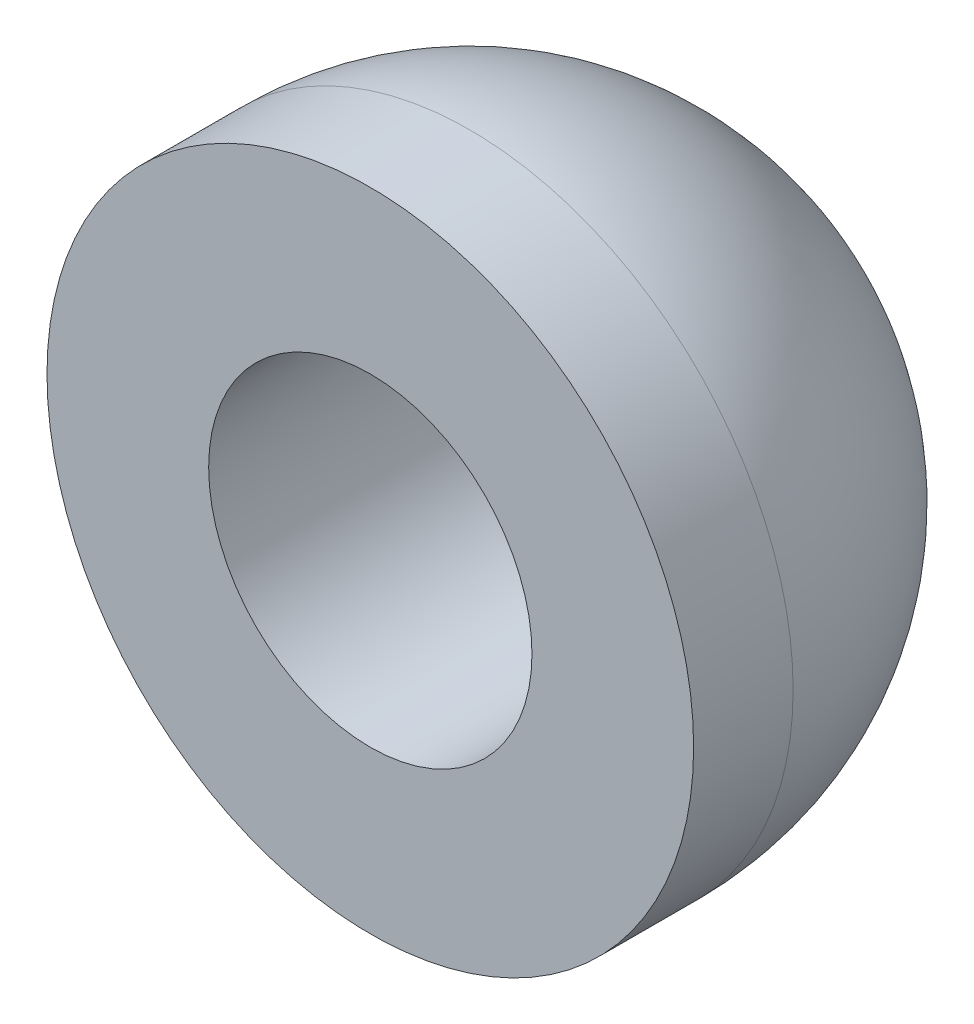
from build123d import *

# Parameters (mm, degrees)
ESQUISSE2_R             = 4.631903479
ENL_V_MAT_EXTRU_2_DEPTH = 1


with BuildPart() as part:
    # Esquisse1 → R_volution1 (revolve)
    with BuildSketch(Plane(origin=(0, 0, 0), x_dir=(0, 0, -1), z_dir=(1, 0, 0)), mode=Mode.PRIVATE) as r_volution1_sk:
        with BuildLine():
            Line((0, 3.25), (7.629165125, 3.25))
            ThreePointArc((7.629165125, 3.25), (5.25, 5.629165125), (2, 6.5))
            Line((2, 6.5), (0, 6.5))
            Line((0, 6.5), (0, 3.25))
        make_face()
    revolve(r_volution1_sk.sketch.rotate(Axis((0, 0, 0), (0, 0, -1)), 90), axis=Axis((0, 0, 0), (0, 0, -1)))

    # Esquisse2 → Enl_v. mat.-Extru.2 (cut)
    with BuildSketch(Plane.XY.offset(-7.5)):
        Circle(ESQUISSE2_R)
    extrude(amount=-ENL_V_MAT_EXTRU_2_DEPTH, mode=Mode.SUBTRACT)


solid = part.part
